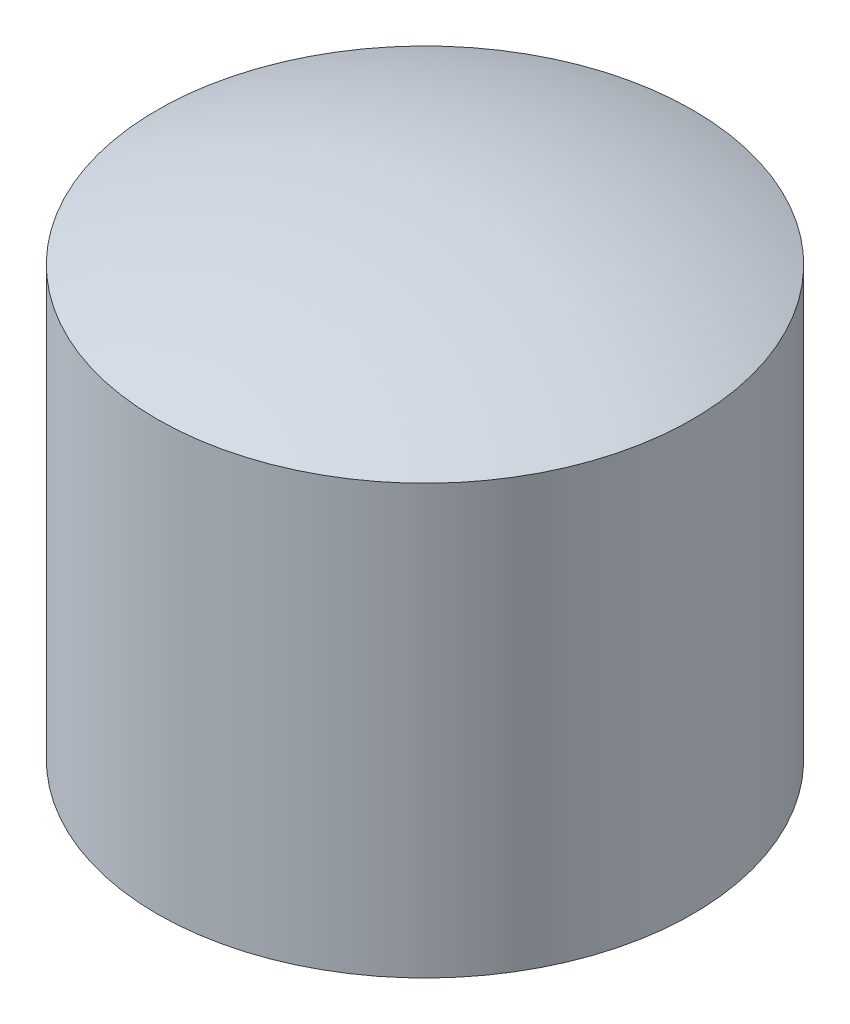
from build123d import *

# Parameters (mm, degrees)
SKETCH1_R         = 5
EXTRUDE1_DEPTH    = 8
DOME1_FACE_RADIUS = 5
DOME1_HEIGHT      = 1


with BuildPart() as part:
    # Sketch1 → Extrude1 (new body)
    with BuildSketch(Plane(origin=(0, 0, 0), x_dir=(1, 0, 0), z_dir=(0, 1, 0))):
        with Locations(Location((0, 0, 0), (0, 0, 270))):
            Circle(SKETCH1_R)
    extrude(amount=EXTRUDE1_DEPTH)

    # Dome1: a dome of height H over a round flat face of radius A is a cap of a sphere of radius (A * A + H * H) / (2 * H)
    dome1_r = (DOME1_FACE_RADIUS * DOME1_FACE_RADIUS + DOME1_HEIGHT * DOME1_HEIGHT) / (2 * DOME1_HEIGHT)
    dome1_base = Plane((0, 8, 0), z_dir=(0, 1, 0))
    with Locations(dome1_base.offset(DOME1_HEIGHT - dome1_r)):
        dome1_ball = Sphere(dome1_r, mode=Mode.PRIVATE)
    add(split(dome1_ball, bisect_by=dome1_base, keep=Keep.TOP, mode=Mode.PRIVATE))


solid = part.part
